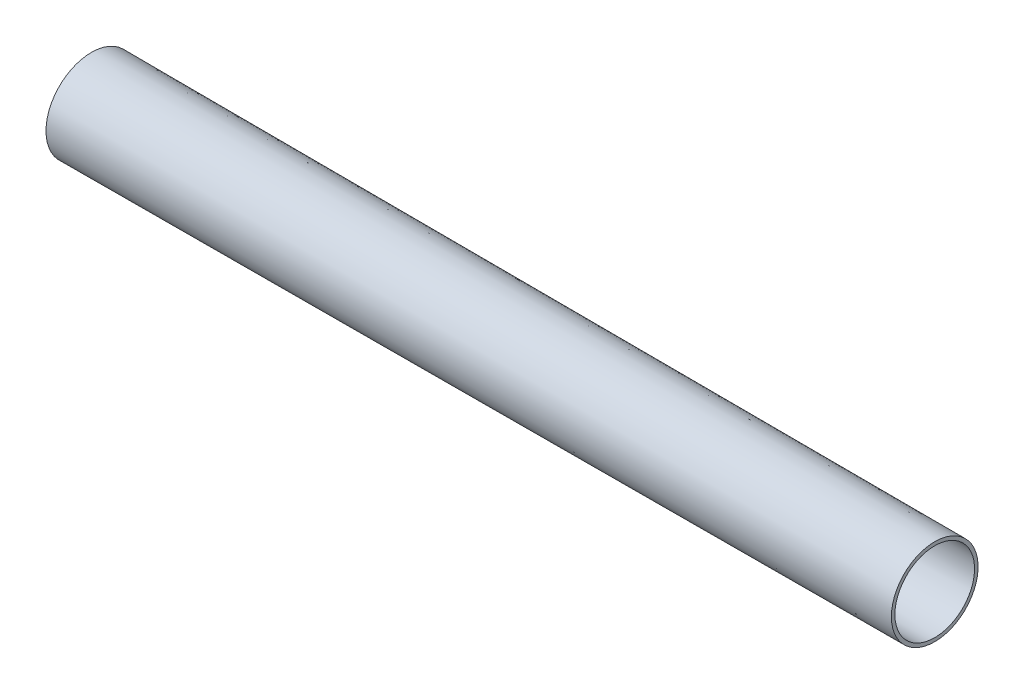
ISO-10303-21;
HEADER;
FILE_DESCRIPTION(('STEP AP214'),'2;1');
FILE_NAME('part.step','',(''),(''),'','','');
FILE_SCHEMA(('AUTOMOTIVE_DESIGN { 1 0 10303 214 1 1 1 1 }'));
ENDSEC;
DATA;
#1=APPLICATION_CONTEXT('core data for automotive mechanical design processes');
#2=APPLICATION_PROTOCOL_DEFINITION('international standard','automotive_design',2000,#1);
#3=PRODUCT_CONTEXT('',#1,'mechanical');
#4=PRODUCT('Part','Part','',(#3));
#5=PRODUCT_RELATED_PRODUCT_CATEGORY('part','',(#4));
#6=PRODUCT_DEFINITION_FORMATION('','',#4);
#7=PRODUCT_DEFINITION_CONTEXT('part definition',#1,'design');
#8=PRODUCT_DEFINITION('design','',#6,#7);
#9=PRODUCT_DEFINITION_SHAPE('','',#8);
#10=(LENGTH_UNIT() NAMED_UNIT(*) SI_UNIT(.MILLI.,.METRE.));
#11=(NAMED_UNIT(*) PLANE_ANGLE_UNIT() SI_UNIT($,.RADIAN.));
#12=(NAMED_UNIT(*) SI_UNIT($,.STERADIAN.) SOLID_ANGLE_UNIT());
#13=UNCERTAINTY_MEASURE_WITH_UNIT(LENGTH_MEASURE(1.E-05),#10,'distance_accuracy_value','');
#14=(GEOMETRIC_REPRESENTATION_CONTEXT(3) GLOBAL_UNCERTAINTY_ASSIGNED_CONTEXT((#13)) GLOBAL_UNIT_ASSIGNED_CONTEXT((#10,
#11,#12)) REPRESENTATION_CONTEXT('',''));
#15=CARTESIAN_POINT('',(0.,0.,0.));
#16=DIRECTION('',(0.,0.,1.));
#17=DIRECTION('',(1.,0.,0.));
#18=AXIS2_PLACEMENT_3D('',#15,#16,#17);
#19=CARTESIAN_POINT('',(34.29,0.,0.));
#20=DIRECTION('',(-1.,0.,0.));
#21=DIRECTION('',(0.,0.,1.));
#22=AXIS2_PLACEMENT_3D('',#19,#20,#21);
#23=CONICAL_SURFACE('',#22,11.9704255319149,0.00238894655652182);
#24=CARTESIAN_POINT('',(275.59,0.,0.));
#25=DIRECTION('',(-1.,0.,0.));
#26=DIRECTION('',(0.,0.,1.));
#27=AXIS2_PLACEMENT_3D('',#24,#25,#26);
#28=CIRCLE('',#27,11.3939716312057);
#29=CARTESIAN_POINT('',(275.59,0.,11.3939716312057));
#30=VERTEX_POINT('',#29);
#31=EDGE_CURVE('E10',#30,#30,#28,.T.);
#32=ORIENTED_EDGE('',*,*,#31,.F.);
#33=EDGE_LOOP('',(#32));
#34=FACE_BOUND('',#33,.T.);
#35=CARTESIAN_POINT('',(34.29,0.,0.));
#36=DIRECTION('',(-1.,0.,0.));
#37=DIRECTION('',(0.,0.,1.));
#38=AXIS2_PLACEMENT_3D('',#35,#36,#37);
#39=CIRCLE('',#38,11.9704255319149);
#40=CARTESIAN_POINT('',(34.29,0.,11.9704255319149));
#41=VERTEX_POINT('',#40);
#42=EDGE_CURVE('E47',#41,#41,#39,.T.);
#43=ORIENTED_EDGE('',*,*,#42,.T.);
#44=EDGE_LOOP('',(#43));
#45=FACE_BOUND('',#44,.T.);
#46=ADVANCED_FACE('F33',(#34,#45),#23,.F.);
#47=CARTESIAN_POINT('',(275.59,11.3939716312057,0.));
#48=DIRECTION('',(-1.,0.,0.));
#49=DIRECTION('',(0.,0.,1.));
#50=AXIS2_PLACEMENT_3D('',#47,#48,#49);
#51=PLANE('',#50);
#52=CARTESIAN_POINT('',(275.59,0.,0.));
#53=DIRECTION('',(-1.,0.,0.));
#54=DIRECTION('',(0.,0.,1.));
#55=AXIS2_PLACEMENT_3D('',#52,#53,#54);
#56=CIRCLE('',#55,12.4027659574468);
#57=CARTESIAN_POINT('',(275.59,0.,12.4027659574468));
#58=VERTEX_POINT('',#57);
#59=EDGE_CURVE('E39',#58,#58,#56,.T.);
#60=ORIENTED_EDGE('',*,*,#59,.F.);
#61=EDGE_LOOP('',(#60));
#62=FACE_BOUND('',#61,.T.);
#63=ORIENTED_EDGE('',*,*,#31,.T.);
#64=EDGE_LOOP('',(#63));
#65=FACE_BOUND('',#64,.T.);
#66=ADVANCED_FACE('F62',(#62,#65),#51,.F.);
#67=CARTESIAN_POINT('',(275.59,0.,0.));
#68=DIRECTION('',(-1.,0.,0.));
#69=DIRECTION('',(0.,0.,1.));
#70=AXIS2_PLACEMENT_3D('',#67,#68,#69);
#71=CONICAL_SURFACE('',#70,12.4027659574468,0.00238894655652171);
#72=CARTESIAN_POINT('',(34.29,0.,0.));
#73=DIRECTION('',(-1.,0.,0.));
#74=DIRECTION('',(0.,0.,1.));
#75=AXIS2_PLACEMENT_3D('',#72,#73,#74);
#76=CIRCLE('',#75,12.979219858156);
#77=CARTESIAN_POINT('',(34.29,0.,12.979219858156));
#78=VERTEX_POINT('',#77);
#79=EDGE_CURVE('E43',#78,#78,#76,.T.);
#80=ORIENTED_EDGE('',*,*,#79,.F.);
#81=EDGE_LOOP('',(#80));
#82=FACE_BOUND('',#81,.T.);
#83=ORIENTED_EDGE('',*,*,#59,.T.);
#84=EDGE_LOOP('',(#83));
#85=FACE_BOUND('',#84,.T.);
#86=ADVANCED_FACE('F57',(#82,#85),#71,.T.);
#87=CARTESIAN_POINT('',(34.29,12.979219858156,0.));
#88=DIRECTION('',(1.,0.,0.));
#89=DIRECTION('',(0.,0.,-1.));
#90=AXIS2_PLACEMENT_3D('',#87,#88,#89);
#91=PLANE('',#90);
#92=ORIENTED_EDGE('',*,*,#42,.F.);
#93=EDGE_LOOP('',(#92));
#94=FACE_BOUND('',#93,.T.);
#95=ORIENTED_EDGE('',*,*,#79,.T.);
#96=EDGE_LOOP('',(#95));
#97=FACE_BOUND('',#96,.T.);
#98=ADVANCED_FACE('F54',(#94,#97),#91,.F.);
#99=CLOSED_SHELL('',(#46,#66,#86,#98));
#100=MANIFOLD_SOLID_BREP('B2',#99);
#101=ADVANCED_BREP_SHAPE_REPRESENTATION('',(#18,#100),#14);
#102=SHAPE_DEFINITION_REPRESENTATION(#9,#101);
ENDSEC;
END-ISO-10303-21;
